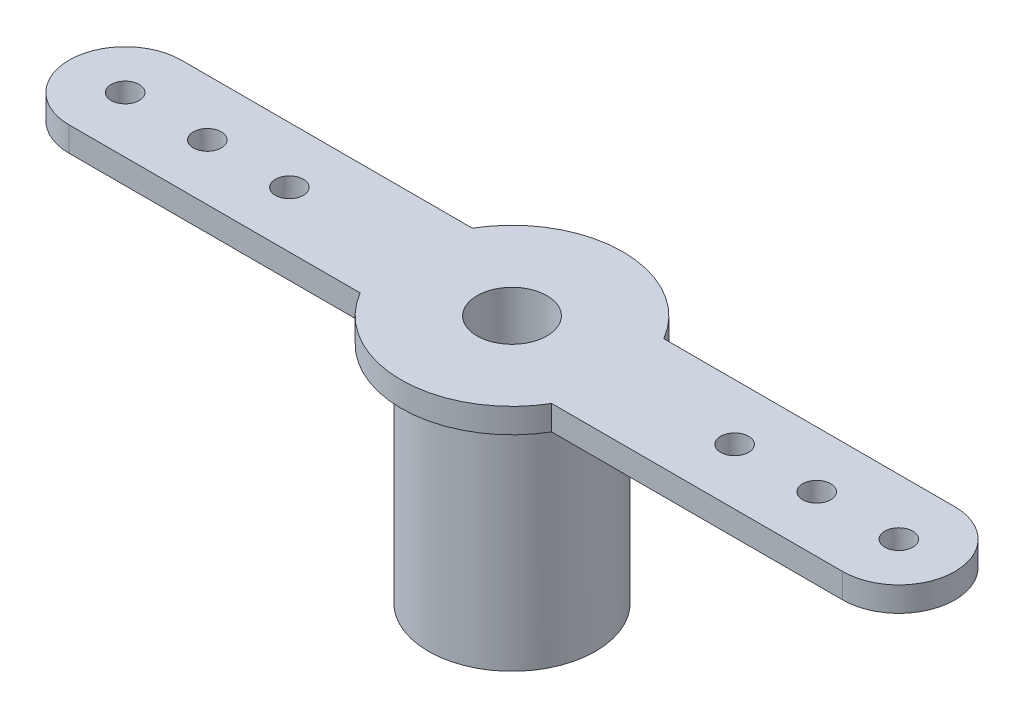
ISO-10303-21;
HEADER;
FILE_DESCRIPTION(('STEP AP214'),'2;1');
FILE_NAME('part.step','',(''),(''),'','','');
FILE_SCHEMA(('AUTOMOTIVE_DESIGN { 1 0 10303 214 1 1 1 1 }'));
ENDSEC;
DATA;
#1=APPLICATION_CONTEXT('core data for automotive mechanical design processes');
#2=APPLICATION_PROTOCOL_DEFINITION('international standard','automotive_design',2000,#1);
#3=PRODUCT_CONTEXT('',#1,'mechanical');
#4=PRODUCT('Part','Part','',(#3));
#5=PRODUCT_RELATED_PRODUCT_CATEGORY('part','',(#4));
#6=PRODUCT_DEFINITION_FORMATION('','',#4);
#7=PRODUCT_DEFINITION_CONTEXT('part definition',#1,'design');
#8=PRODUCT_DEFINITION('design','',#6,#7);
#9=PRODUCT_DEFINITION_SHAPE('','',#8);
#10=(LENGTH_UNIT() NAMED_UNIT(*) SI_UNIT(.MILLI.,.METRE.));
#11=(NAMED_UNIT(*) PLANE_ANGLE_UNIT() SI_UNIT($,.RADIAN.));
#12=(NAMED_UNIT(*) SI_UNIT($,.STERADIAN.) SOLID_ANGLE_UNIT());
#13=UNCERTAINTY_MEASURE_WITH_UNIT(LENGTH_MEASURE(1.E-05),#10,'distance_accuracy_value','');
#14=(GEOMETRIC_REPRESENTATION_CONTEXT(3) GLOBAL_UNCERTAINTY_ASSIGNED_CONTEXT((#13)) GLOBAL_UNIT_ASSIGNED_CONTEXT((#10,
#11,#12)) REPRESENTATION_CONTEXT('',''));
#15=CARTESIAN_POINT('',(0.,0.,0.));
#16=DIRECTION('',(0.,0.,1.));
#17=DIRECTION('',(1.,0.,0.));
#18=AXIS2_PLACEMENT_3D('',#15,#16,#17);
#19=CARTESIAN_POINT('',(0.,0.,0.));
#20=DIRECTION('',(0.,1.,0.));
#21=DIRECTION('',(0.,0.,1.));
#22=AXIS2_PLACEMENT_3D('',#19,#20,#21);
#23=PLANE('',#22);
#24=CARTESIAN_POINT('',(17.44,0.,0.));
#25=DIRECTION('',(0.,1.,0.));
#26=DIRECTION('',(0.,0.,1.));
#27=AXIS2_PLACEMENT_3D('',#24,#25,#26);
#28=CIRCLE('',#27,0.799999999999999);
#29=CARTESIAN_POINT('',(17.44,0.,0.799999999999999));
#30=VERTEX_POINT('',#29);
#31=EDGE_CURVE('E221',#30,#30,#28,.T.);
#32=ORIENTED_EDGE('',*,*,#31,.T.);
#33=EDGE_LOOP('',(#32));
#34=FACE_BOUND('',#33,.T.);
#35=CARTESIAN_POINT('',(22.14,0.,0.));
#36=DIRECTION('',(0.,1.,0.));
#37=DIRECTION('',(0.,0.,1.));
#38=AXIS2_PLACEMENT_3D('',#35,#36,#37);
#39=CIRCLE('',#38,0.800000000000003);
#40=CARTESIAN_POINT('',(22.14,0.,0.800000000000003));
#41=VERTEX_POINT('',#40);
#42=EDGE_CURVE('E209',#41,#41,#39,.T.);
#43=ORIENTED_EDGE('',*,*,#42,.T.);
#44=EDGE_LOOP('',(#43));
#45=FACE_BOUND('',#44,.T.);
#46=CARTESIAN_POINT('',(-12.74,0.,0.));
#47=DIRECTION('',(0.,1.,0.));
#48=DIRECTION('',(0.,0.,1.));
#49=AXIS2_PLACEMENT_3D('',#46,#47,#48);
#50=CIRCLE('',#49,0.800000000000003);
#51=CARTESIAN_POINT('',(-12.74,0.,0.800000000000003));
#52=VERTEX_POINT('',#51);
#53=EDGE_CURVE('E197',#52,#52,#50,.T.);
#54=ORIENTED_EDGE('',*,*,#53,.T.);
#55=EDGE_LOOP('',(#54));
#56=FACE_BOUND('',#55,.T.);
#57=CARTESIAN_POINT('',(0.,0.,0.));
#58=DIRECTION('',(0.,1.,0.));
#59=DIRECTION('',(0.,0.,1.));
#60=AXIS2_PLACEMENT_3D('',#57,#58,#59);
#61=CIRCLE('',#60,6.35);
#62=CARTESIAN_POINT('',(5.47890500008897,0.,-3.21000000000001));
#63=VERTEX_POINT('',#62);
#64=CARTESIAN_POINT('',(-5.47890500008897,0.,-3.21000000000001));
#65=VERTEX_POINT('',#64);
#66=EDGE_CURVE('E138',#63,#65,#61,.T.);
#67=ORIENTED_EDGE('',*,*,#66,.F.);
#68=DIRECTION('',(-1.,0.,0.));
#69=VECTOR('',#68,1.);
#70=CARTESIAN_POINT('',(5.47890500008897,0.,-3.21000000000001));
#71=LINE('',#70,#69);
#72=CARTESIAN_POINT('',(22.14,0.,-3.21));
#73=VERTEX_POINT('',#72);
#74=EDGE_CURVE('E91',#73,#63,#71,.T.);
#75=ORIENTED_EDGE('',*,*,#74,.F.);
#76=CARTESIAN_POINT('',(22.14,0.,0.));
#77=DIRECTION('',(0.,1.,0.));
#78=DIRECTION('',(0.,0.,1.));
#79=AXIS2_PLACEMENT_3D('',#76,#77,#78);
#80=CIRCLE('',#79,3.21);
#81=CARTESIAN_POINT('',(22.14,0.,3.21));
#82=VERTEX_POINT('',#81);
#83=EDGE_CURVE('E85',#82,#73,#80,.T.);
#84=ORIENTED_EDGE('',*,*,#83,.F.);
#85=DIRECTION('',(1.,0.,0.));
#86=VECTOR('',#85,1.);
#87=CARTESIAN_POINT('',(22.14,0.,3.21));
#88=LINE('',#87,#86);
#89=CARTESIAN_POINT('',(5.47890500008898,0.,3.21));
#90=VERTEX_POINT('',#89);
#91=EDGE_CURVE('E128',#90,#82,#88,.T.);
#92=ORIENTED_EDGE('',*,*,#91,.F.);
#93=CARTESIAN_POINT('',(0.,0.,0.));
#94=DIRECTION('',(0.,1.,0.));
#95=DIRECTION('',(0.,0.,1.));
#96=AXIS2_PLACEMENT_3D('',#93,#94,#95);
#97=CIRCLE('',#96,6.35);
#98=CARTESIAN_POINT('',(-5.47890500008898,0.,3.21));
#99=VERTEX_POINT('',#98);
#100=EDGE_CURVE('E148',#99,#90,#97,.T.);
#101=ORIENTED_EDGE('',*,*,#100,.F.);
#102=DIRECTION('',(1.,0.,0.));
#103=VECTOR('',#102,1.);
#104=CARTESIAN_POINT('',(-5.47890500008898,0.,3.21));
#105=LINE('',#104,#103);
#106=CARTESIAN_POINT('',(-22.14,0.,3.21));
#107=VERTEX_POINT('',#106);
#108=EDGE_CURVE('E146',#107,#99,#105,.T.);
#109=ORIENTED_EDGE('',*,*,#108,.F.);
#110=CARTESIAN_POINT('',(-22.14,0.,0.));
#111=DIRECTION('',(0.,1.,0.));
#112=DIRECTION('',(0.,0.,1.));
#113=AXIS2_PLACEMENT_3D('',#110,#111,#112);
#114=CIRCLE('',#113,3.21);
#115=CARTESIAN_POINT('',(-22.14,0.,-3.21));
#116=VERTEX_POINT('',#115);
#117=EDGE_CURVE('E144',#116,#107,#114,.T.);
#118=ORIENTED_EDGE('',*,*,#117,.F.);
#119=DIRECTION('',(-1.,0.,0.));
#120=VECTOR('',#119,1.);
#121=CARTESIAN_POINT('',(-22.14,0.,-3.21));
#122=LINE('',#121,#120);
#123=EDGE_CURVE('E141',#65,#116,#122,.T.);
#124=ORIENTED_EDGE('',*,*,#123,.F.);
#125=EDGE_LOOP('',(#67,#75,#84,#92,#101,#109,#118,#124));
#126=FACE_BOUND('',#125,.T.);
#127=CARTESIAN_POINT('',(-22.14,0.,0.));
#128=DIRECTION('',(0.,1.,0.));
#129=DIRECTION('',(0.,0.,1.));
#130=AXIS2_PLACEMENT_3D('',#127,#128,#129);
#131=CIRCLE('',#130,0.800000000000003);
#132=CARTESIAN_POINT('',(-22.14,0.,0.800000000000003));
#133=VERTEX_POINT('',#132);
#134=EDGE_CURVE('E191',#133,#133,#131,.T.);
#135=ORIENTED_EDGE('',*,*,#134,.T.);
#136=EDGE_LOOP('',(#135));
#137=FACE_BOUND('',#136,.T.);
#138=CARTESIAN_POINT('',(-17.44,0.,0.));
#139=DIRECTION('',(0.,1.,0.));
#140=DIRECTION('',(0.,0.,1.));
#141=AXIS2_PLACEMENT_3D('',#138,#139,#140);
#142=CIRCLE('',#141,0.800000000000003);
#143=CARTESIAN_POINT('',(-17.44,0.,0.800000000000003));
#144=VERTEX_POINT('',#143);
#145=EDGE_CURVE('E203',#144,#144,#142,.T.);
#146=ORIENTED_EDGE('',*,*,#145,.T.);
#147=EDGE_LOOP('',(#146));
#148=FACE_BOUND('',#147,.T.);
#149=CARTESIAN_POINT('',(12.74,0.,0.));
#150=DIRECTION('',(0.,1.,0.));
#151=DIRECTION('',(0.,0.,1.));
#152=AXIS2_PLACEMENT_3D('',#149,#150,#151);
#153=CIRCLE('',#152,0.800000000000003);
#154=CARTESIAN_POINT('',(12.74,0.,0.800000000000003));
#155=VERTEX_POINT('',#154);
#156=EDGE_CURVE('E215',#155,#155,#153,.T.);
#157=ORIENTED_EDGE('',*,*,#156,.T.);
#158=EDGE_LOOP('',(#157));
#159=FACE_BOUND('',#158,.T.);
#160=CARTESIAN_POINT('',(0.,0.,0.));
#161=DIRECTION('',(0.,1.,0.));
#162=DIRECTION('',(0.,0.,1.));
#163=AXIS2_PLACEMENT_3D('',#160,#161,#162);
#164=CIRCLE('',#163,4.785);
#165=CARTESIAN_POINT('',(0.,0.,4.785));
#166=VERTEX_POINT('',#165);
#167=EDGE_CURVE('E11',#166,#166,#164,.F.);
#168=ORIENTED_EDGE('',*,*,#167,.F.);
#169=EDGE_LOOP('',(#168));
#170=FACE_BOUND('',#169,.T.);
#171=ADVANCED_FACE('F34',(#34,#45,#56,#126,#137,#148,#159,#170),#23,.F.);
#172=CARTESIAN_POINT('',(0.,1.41,0.));
#173=DIRECTION('',(0.,1.,0.));
#174=DIRECTION('',(0.,0.,1.));
#175=AXIS2_PLACEMENT_3D('',#172,#173,#174);
#176=PLANE('',#175);
#177=CARTESIAN_POINT('',(0.,1.41,0.));
#178=DIRECTION('',(0.,-1.,0.));
#179=DIRECTION('',(0.,0.,-1.));
#180=AXIS2_PLACEMENT_3D('',#177,#178,#179);
#181=CIRCLE('',#180,2.);
#182=CARTESIAN_POINT('',(0.,1.41,-2.));
#183=VERTEX_POINT('',#182);
#184=EDGE_CURVE('E229',#183,#183,#181,.T.);
#185=ORIENTED_EDGE('',*,*,#184,.T.);
#186=EDGE_LOOP('',(#185));
#187=FACE_BOUND('',#186,.T.);
#188=CARTESIAN_POINT('',(12.74,1.41,0.));
#189=DIRECTION('',(0.,1.,0.));
#190=DIRECTION('',(0.,0.,1.));
#191=AXIS2_PLACEMENT_3D('',#188,#189,#190);
#192=CIRCLE('',#191,0.800000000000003);
#193=CARTESIAN_POINT('',(12.74,1.41,0.800000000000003));
#194=VERTEX_POINT('',#193);
#195=EDGE_CURVE('E212',#194,#194,#192,.T.);
#196=ORIENTED_EDGE('',*,*,#195,.F.);
#197=EDGE_LOOP('',(#196));
#198=FACE_BOUND('',#197,.T.);
#199=CARTESIAN_POINT('',(-17.44,1.41,0.));
#200=DIRECTION('',(0.,1.,0.));
#201=DIRECTION('',(0.,0.,1.));
#202=AXIS2_PLACEMENT_3D('',#199,#200,#201);
#203=CIRCLE('',#202,0.800000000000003);
#204=CARTESIAN_POINT('',(-17.44,1.41,0.800000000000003));
#205=VERTEX_POINT('',#204);
#206=EDGE_CURVE('E200',#205,#205,#203,.T.);
#207=ORIENTED_EDGE('',*,*,#206,.F.);
#208=EDGE_LOOP('',(#207));
#209=FACE_BOUND('',#208,.T.);
#210=CARTESIAN_POINT('',(-22.14,1.41,0.));
#211=DIRECTION('',(0.,1.,0.));
#212=DIRECTION('',(0.,0.,1.));
#213=AXIS2_PLACEMENT_3D('',#210,#211,#212);
#214=CIRCLE('',#213,0.800000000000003);
#215=CARTESIAN_POINT('',(-22.14,1.41,0.800000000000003));
#216=VERTEX_POINT('',#215);
#217=EDGE_CURVE('E142',#216,#216,#214,.T.);
#218=ORIENTED_EDGE('',*,*,#217,.F.);
#219=EDGE_LOOP('',(#218));
#220=FACE_BOUND('',#219,.T.);
#221=CARTESIAN_POINT('',(0.,1.41,0.));
#222=DIRECTION('',(0.,1.,0.));
#223=DIRECTION('',(0.,0.,1.));
#224=AXIS2_PLACEMENT_3D('',#221,#222,#223);
#225=CIRCLE('',#224,6.35);
#226=CARTESIAN_POINT('',(5.47890500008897,1.41,-3.21000000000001));
#227=VERTEX_POINT('',#226);
#228=CARTESIAN_POINT('',(-5.47890500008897,1.41,-3.21000000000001));
#229=VERTEX_POINT('',#228);
#230=EDGE_CURVE('E153',#227,#229,#225,.T.);
#231=ORIENTED_EDGE('',*,*,#230,.T.);
#232=DIRECTION('',(-1.,0.,0.));
#233=VECTOR('',#232,1.);
#234=CARTESIAN_POINT('',(-22.14,1.41,-3.21));
#235=LINE('',#234,#233);
#236=CARTESIAN_POINT('',(-22.14,1.41,-3.21));
#237=VERTEX_POINT('',#236);
#238=EDGE_CURVE('E100',#229,#237,#235,.T.);
#239=ORIENTED_EDGE('',*,*,#238,.T.);
#240=CARTESIAN_POINT('',(-22.14,1.41,0.));
#241=DIRECTION('',(0.,1.,0.));
#242=DIRECTION('',(0.,0.,1.));
#243=AXIS2_PLACEMENT_3D('',#240,#241,#242);
#244=CIRCLE('',#243,3.21);
#245=CARTESIAN_POINT('',(-22.14,1.41,3.21));
#246=VERTEX_POINT('',#245);
#247=EDGE_CURVE('E185',#237,#246,#244,.T.);
#248=ORIENTED_EDGE('',*,*,#247,.T.);
#249=DIRECTION('',(1.,0.,0.));
#250=VECTOR('',#249,1.);
#251=CARTESIAN_POINT('',(-5.47890500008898,1.41,3.21));
#252=LINE('',#251,#250);
#253=CARTESIAN_POINT('',(-5.47890500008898,1.41,3.21));
#254=VERTEX_POINT('',#253);
#255=EDGE_CURVE('E184',#246,#254,#252,.T.);
#256=ORIENTED_EDGE('',*,*,#255,.T.);
#257=CARTESIAN_POINT('',(0.,1.41,0.));
#258=DIRECTION('',(0.,1.,0.));
#259=DIRECTION('',(0.,0.,1.));
#260=AXIS2_PLACEMENT_3D('',#257,#258,#259);
#261=CIRCLE('',#260,6.35);
#262=CARTESIAN_POINT('',(5.47890500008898,1.41,3.21));
#263=VERTEX_POINT('',#262);
#264=EDGE_CURVE('E120',#254,#263,#261,.T.);
#265=ORIENTED_EDGE('',*,*,#264,.T.);
#266=DIRECTION('',(1.,0.,0.));
#267=VECTOR('',#266,1.);
#268=CARTESIAN_POINT('',(22.14,1.41,3.21));
#269=LINE('',#268,#267);
#270=CARTESIAN_POINT('',(22.14,1.41,3.21));
#271=VERTEX_POINT('',#270);
#272=EDGE_CURVE('E113',#263,#271,#269,.T.);
#273=ORIENTED_EDGE('',*,*,#272,.T.);
#274=CARTESIAN_POINT('',(22.14,1.41,0.));
#275=DIRECTION('',(0.,1.,0.));
#276=DIRECTION('',(0.,0.,1.));
#277=AXIS2_PLACEMENT_3D('',#274,#275,#276);
#278=CIRCLE('',#277,3.21);
#279=CARTESIAN_POINT('',(22.14,1.41,-3.21));
#280=VERTEX_POINT('',#279);
#281=EDGE_CURVE('E118',#271,#280,#278,.T.);
#282=ORIENTED_EDGE('',*,*,#281,.T.);
#283=DIRECTION('',(-1.,0.,0.));
#284=VECTOR('',#283,1.);
#285=CARTESIAN_POINT('',(5.47890500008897,1.41,-3.21000000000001));
#286=LINE('',#285,#284);
#287=EDGE_CURVE('E56',#280,#227,#286,.T.);
#288=ORIENTED_EDGE('',*,*,#287,.T.);
#289=EDGE_LOOP('',(#231,#239,#248,#256,#265,#273,#282,#288));
#290=FACE_BOUND('',#289,.T.);
#291=CARTESIAN_POINT('',(-12.74,1.41,0.));
#292=DIRECTION('',(0.,1.,0.));
#293=DIRECTION('',(0.,0.,1.));
#294=AXIS2_PLACEMENT_3D('',#291,#292,#293);
#295=CIRCLE('',#294,0.800000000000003);
#296=CARTESIAN_POINT('',(-12.74,1.41,0.800000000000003));
#297=VERTEX_POINT('',#296);
#298=EDGE_CURVE('E194',#297,#297,#295,.T.);
#299=ORIENTED_EDGE('',*,*,#298,.F.);
#300=EDGE_LOOP('',(#299));
#301=FACE_BOUND('',#300,.T.);
#302=CARTESIAN_POINT('',(22.14,1.41,0.));
#303=DIRECTION('',(0.,1.,0.));
#304=DIRECTION('',(0.,0.,1.));
#305=AXIS2_PLACEMENT_3D('',#302,#303,#304);
#306=CIRCLE('',#305,0.800000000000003);
#307=CARTESIAN_POINT('',(22.14,1.41,0.800000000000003));
#308=VERTEX_POINT('',#307);
#309=EDGE_CURVE('E206',#308,#308,#306,.T.);
#310=ORIENTED_EDGE('',*,*,#309,.F.);
#311=EDGE_LOOP('',(#310));
#312=FACE_BOUND('',#311,.T.);
#313=CARTESIAN_POINT('',(17.44,1.41,0.));
#314=DIRECTION('',(0.,1.,0.));
#315=DIRECTION('',(0.,0.,1.));
#316=AXIS2_PLACEMENT_3D('',#313,#314,#315);
#317=CIRCLE('',#316,0.799999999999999);
#318=CARTESIAN_POINT('',(17.44,1.41,0.799999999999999));
#319=VERTEX_POINT('',#318);
#320=EDGE_CURVE('E218',#319,#319,#317,.T.);
#321=ORIENTED_EDGE('',*,*,#320,.F.);
#322=EDGE_LOOP('',(#321));
#323=FACE_BOUND('',#322,.T.);
#324=ADVANCED_FACE('F115',(#187,#198,#209,#220,#290,#301,#312,#323),#176,.T.);
#325=CARTESIAN_POINT('',(0.,1.41,0.));
#326=DIRECTION('',(0.,-1.,0.));
#327=DIRECTION('',(0.,0.,-1.));
#328=AXIS2_PLACEMENT_3D('',#325,#326,#327);
#329=CYLINDRICAL_SURFACE('',#328,6.35);
#330=ORIENTED_EDGE('',*,*,#66,.T.);
#331=DIRECTION('',(0.,-1.,0.));
#332=VECTOR('',#331,1.);
#333=CARTESIAN_POINT('',(-5.47890500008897,1.41,-3.21000000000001));
#334=LINE('',#333,#332);
#335=EDGE_CURVE('E48',#229,#65,#334,.T.);
#336=ORIENTED_EDGE('',*,*,#335,.F.);
#337=ORIENTED_EDGE('',*,*,#230,.F.);
#338=DIRECTION('',(0.,-1.,0.));
#339=VECTOR('',#338,1.);
#340=CARTESIAN_POINT('',(5.47890500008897,1.41,-3.21000000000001));
#341=LINE('',#340,#339);
#342=EDGE_CURVE('E134',#227,#63,#341,.T.);
#343=ORIENTED_EDGE('',*,*,#342,.T.);
#344=EDGE_LOOP('',(#330,#336,#337,#343));
#345=FACE_BOUND('',#344,.T.);
#346=ADVANCED_FACE('F36',(#345),#329,.T.);
#347=CARTESIAN_POINT('',(-22.14,1.41,-3.21));
#348=DIRECTION('',(0.,0.,1.));
#349=DIRECTION('',(1.,0.,0.));
#350=AXIS2_PLACEMENT_3D('',#347,#348,#349);
#351=PLANE('',#350);
#352=ORIENTED_EDGE('',*,*,#123,.T.);
#353=DIRECTION('',(0.,-1.,0.));
#354=VECTOR('',#353,1.);
#355=CARTESIAN_POINT('',(-22.14,1.41,-3.21));
#356=LINE('',#355,#354);
#357=EDGE_CURVE('E163',#237,#116,#356,.T.);
#358=ORIENTED_EDGE('',*,*,#357,.F.);
#359=ORIENTED_EDGE('',*,*,#238,.F.);
#360=ORIENTED_EDGE('',*,*,#335,.T.);
#361=EDGE_LOOP('',(#352,#358,#359,#360));
#362=FACE_BOUND('',#361,.T.);
#363=ADVANCED_FACE('F167',(#362),#351,.F.);
#364=CARTESIAN_POINT('',(-22.14,1.41,0.));
#365=DIRECTION('',(0.,-1.,0.));
#366=DIRECTION('',(0.,0.,-1.));
#367=AXIS2_PLACEMENT_3D('',#364,#365,#366);
#368=CYLINDRICAL_SURFACE('',#367,3.21);
#369=ORIENTED_EDGE('',*,*,#117,.T.);
#370=DIRECTION('',(0.,-1.,0.));
#371=VECTOR('',#370,1.);
#372=CARTESIAN_POINT('',(-22.14,1.41,3.21));
#373=LINE('',#372,#371);
#374=EDGE_CURVE('E160',#246,#107,#373,.T.);
#375=ORIENTED_EDGE('',*,*,#374,.F.);
#376=ORIENTED_EDGE('',*,*,#247,.F.);
#377=ORIENTED_EDGE('',*,*,#357,.T.);
#378=EDGE_LOOP('',(#369,#375,#376,#377));
#379=FACE_BOUND('',#378,.T.);
#380=ADVANCED_FACE('F178',(#379),#368,.T.);
#381=CARTESIAN_POINT('',(-5.47890500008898,1.41,3.21));
#382=DIRECTION('',(0.,0.,-1.));
#383=DIRECTION('',(-1.,0.,0.));
#384=AXIS2_PLACEMENT_3D('',#381,#382,#383);
#385=PLANE('',#384);
#386=ORIENTED_EDGE('',*,*,#108,.T.);
#387=DIRECTION('',(0.,-1.,0.));
#388=VECTOR('',#387,1.);
#389=CARTESIAN_POINT('',(-5.47890500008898,1.41,3.21));
#390=LINE('',#389,#388);
#391=EDGE_CURVE('E157',#254,#99,#390,.T.);
#392=ORIENTED_EDGE('',*,*,#391,.F.);
#393=ORIENTED_EDGE('',*,*,#255,.F.);
#394=ORIENTED_EDGE('',*,*,#374,.T.);
#395=EDGE_LOOP('',(#386,#392,#393,#394));
#396=FACE_BOUND('',#395,.T.);
#397=ADVANCED_FACE('F182',(#396),#385,.F.);
#398=CARTESIAN_POINT('',(0.,1.41,0.));
#399=DIRECTION('',(0.,-1.,0.));
#400=DIRECTION('',(0.,0.,-1.));
#401=AXIS2_PLACEMENT_3D('',#398,#399,#400);
#402=CYLINDRICAL_SURFACE('',#401,6.35);
#403=ORIENTED_EDGE('',*,*,#100,.T.);
#404=DIRECTION('',(0.,-1.,0.));
#405=VECTOR('',#404,1.);
#406=CARTESIAN_POINT('',(5.47890500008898,1.41,3.21));
#407=LINE('',#406,#405);
#408=EDGE_CURVE('E129',#263,#90,#407,.T.);
#409=ORIENTED_EDGE('',*,*,#408,.F.);
#410=ORIENTED_EDGE('',*,*,#264,.F.);
#411=ORIENTED_EDGE('',*,*,#391,.T.);
#412=EDGE_LOOP('',(#403,#409,#410,#411));
#413=FACE_BOUND('',#412,.T.);
#414=ADVANCED_FACE('F282',(#413),#402,.T.);
#415=CARTESIAN_POINT('',(22.14,1.41,3.21));
#416=DIRECTION('',(0.,0.,-1.));
#417=DIRECTION('',(-1.,0.,0.));
#418=AXIS2_PLACEMENT_3D('',#415,#416,#417);
#419=PLANE('',#418);
#420=ORIENTED_EDGE('',*,*,#91,.T.);
#421=DIRECTION('',(0.,-1.,0.));
#422=VECTOR('',#421,1.);
#423=CARTESIAN_POINT('',(22.14,1.41,3.21));
#424=LINE('',#423,#422);
#425=EDGE_CURVE('E125',#271,#82,#424,.T.);
#426=ORIENTED_EDGE('',*,*,#425,.F.);
#427=ORIENTED_EDGE('',*,*,#272,.F.);
#428=ORIENTED_EDGE('',*,*,#408,.T.);
#429=EDGE_LOOP('',(#420,#426,#427,#428));
#430=FACE_BOUND('',#429,.T.);
#431=ADVANCED_FACE('F126',(#430),#419,.F.);
#432=CARTESIAN_POINT('',(22.14,1.41,0.));
#433=DIRECTION('',(0.,-1.,0.));
#434=DIRECTION('',(0.,0.,-1.));
#435=AXIS2_PLACEMENT_3D('',#432,#433,#434);
#436=CYLINDRICAL_SURFACE('',#435,3.21);
#437=ORIENTED_EDGE('',*,*,#83,.T.);
#438=DIRECTION('',(0.,-1.,0.));
#439=VECTOR('',#438,1.);
#440=CARTESIAN_POINT('',(22.14,1.41,-3.21));
#441=LINE('',#440,#439);
#442=EDGE_CURVE('E130',#280,#73,#441,.T.);
#443=ORIENTED_EDGE('',*,*,#442,.F.);
#444=ORIENTED_EDGE('',*,*,#281,.F.);
#445=ORIENTED_EDGE('',*,*,#425,.T.);
#446=EDGE_LOOP('',(#437,#443,#444,#445));
#447=FACE_BOUND('',#446,.T.);
#448=ADVANCED_FACE('F132',(#447),#436,.T.);
#449=CARTESIAN_POINT('',(5.47890500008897,1.41,-3.21000000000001));
#450=DIRECTION('',(0.,0.,1.));
#451=DIRECTION('',(1.,0.,0.));
#452=AXIS2_PLACEMENT_3D('',#449,#450,#451);
#453=PLANE('',#452);
#454=ORIENTED_EDGE('',*,*,#74,.T.);
#455=ORIENTED_EDGE('',*,*,#342,.F.);
#456=ORIENTED_EDGE('',*,*,#287,.F.);
#457=ORIENTED_EDGE('',*,*,#442,.T.);
#458=EDGE_LOOP('',(#454,#455,#456,#457));
#459=FACE_BOUND('',#458,.T.);
#460=ADVANCED_FACE('F274',(#459),#453,.F.);
#461=CARTESIAN_POINT('',(-22.14,1.41,0.));
#462=DIRECTION('',(0.,-1.,0.));
#463=DIRECTION('',(0.,0.,-1.));
#464=AXIS2_PLACEMENT_3D('',#461,#462,#463);
#465=CYLINDRICAL_SURFACE('',#464,0.800000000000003);
#466=ORIENTED_EDGE('',*,*,#217,.T.);
#467=EDGE_LOOP('',(#466));
#468=FACE_BOUND('',#467,.T.);
#469=ORIENTED_EDGE('',*,*,#134,.F.);
#470=EDGE_LOOP('',(#469));
#471=FACE_BOUND('',#470,.T.);
#472=ADVANCED_FACE('F277',(#468,#471),#465,.F.);
#473=CARTESIAN_POINT('',(-12.74,1.41,0.));
#474=DIRECTION('',(0.,-1.,0.));
#475=DIRECTION('',(0.,0.,-1.));
#476=AXIS2_PLACEMENT_3D('',#473,#474,#475);
#477=CYLINDRICAL_SURFACE('',#476,0.800000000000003);
#478=ORIENTED_EDGE('',*,*,#298,.T.);
#479=EDGE_LOOP('',(#478));
#480=FACE_BOUND('',#479,.T.);
#481=ORIENTED_EDGE('',*,*,#53,.F.);
#482=EDGE_LOOP('',(#481));
#483=FACE_BOUND('',#482,.T.);
#484=ADVANCED_FACE('F354',(#480,#483),#477,.F.);
#485=CARTESIAN_POINT('',(-17.44,1.41,0.));
#486=DIRECTION('',(0.,-1.,0.));
#487=DIRECTION('',(0.,0.,-1.));
#488=AXIS2_PLACEMENT_3D('',#485,#486,#487);
#489=CYLINDRICAL_SURFACE('',#488,0.800000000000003);
#490=ORIENTED_EDGE('',*,*,#206,.T.);
#491=EDGE_LOOP('',(#490));
#492=FACE_BOUND('',#491,.T.);
#493=ORIENTED_EDGE('',*,*,#145,.F.);
#494=EDGE_LOOP('',(#493));
#495=FACE_BOUND('',#494,.T.);
#496=ADVANCED_FACE('F346',(#492,#495),#489,.F.);
#497=CARTESIAN_POINT('',(22.14,1.41,0.));
#498=DIRECTION('',(0.,-1.,0.));
#499=DIRECTION('',(0.,0.,-1.));
#500=AXIS2_PLACEMENT_3D('',#497,#498,#499);
#501=CYLINDRICAL_SURFACE('',#500,0.800000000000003);
#502=ORIENTED_EDGE('',*,*,#309,.T.);
#503=EDGE_LOOP('',(#502));
#504=FACE_BOUND('',#503,.T.);
#505=ORIENTED_EDGE('',*,*,#42,.F.);
#506=EDGE_LOOP('',(#505));
#507=FACE_BOUND('',#506,.T.);
#508=ADVANCED_FACE('F338',(#504,#507),#501,.F.);
#509=CARTESIAN_POINT('',(12.74,1.41,0.));
#510=DIRECTION('',(0.,-1.,0.));
#511=DIRECTION('',(0.,0.,-1.));
#512=AXIS2_PLACEMENT_3D('',#509,#510,#511);
#513=CYLINDRICAL_SURFACE('',#512,0.800000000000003);
#514=ORIENTED_EDGE('',*,*,#195,.T.);
#515=EDGE_LOOP('',(#514));
#516=FACE_BOUND('',#515,.T.);
#517=ORIENTED_EDGE('',*,*,#156,.F.);
#518=EDGE_LOOP('',(#517));
#519=FACE_BOUND('',#518,.T.);
#520=ADVANCED_FACE('F331',(#516,#519),#513,.F.);
#521=CARTESIAN_POINT('',(17.44,1.41,0.));
#522=DIRECTION('',(0.,-1.,0.));
#523=DIRECTION('',(0.,0.,-1.));
#524=AXIS2_PLACEMENT_3D('',#521,#522,#523);
#525=CYLINDRICAL_SURFACE('',#524,0.799999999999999);
#526=ORIENTED_EDGE('',*,*,#320,.T.);
#527=EDGE_LOOP('',(#526));
#528=FACE_BOUND('',#527,.T.);
#529=ORIENTED_EDGE('',*,*,#31,.F.);
#530=EDGE_LOOP('',(#529));
#531=FACE_BOUND('',#530,.T.);
#532=ADVANCED_FACE('F259',(#528,#531),#525,.F.);
#533=CARTESIAN_POINT('',(0.,-12.83,0.));
#534=DIRECTION('',(0.,1.,0.));
#535=DIRECTION('',(0.,0.,1.));
#536=AXIS2_PLACEMENT_3D('',#533,#534,#535);
#537=CYLINDRICAL_SURFACE('',#536,4.785);
#538=CARTESIAN_POINT('',(1.72,-6.01,-4.46517916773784));
#539=CARTESIAN_POINT('',(1.72000219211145,-5.9168021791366,-4.46517722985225));
#540=CARTESIAN_POINT('',(1.71239976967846,-5.82361944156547,-4.46812880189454));
#541=CARTESIAN_POINT('',(1.68231532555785,-5.64004484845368,-4.47954181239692));
#542=CARTESIAN_POINT('',(1.65983272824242,-5.54965310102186,-4.4880034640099));
#543=CARTESIAN_POINT('',(1.60090422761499,-5.37435669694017,-4.50935695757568));
#544=CARTESIAN_POINT('',(1.5644893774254,-5.2894403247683,-4.52223894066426));
#545=CARTESIAN_POINT('',(1.47883870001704,-5.12689068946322,-4.55096634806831));
#546=CARTESIAN_POINT('',(1.42959938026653,-5.04925941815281,-4.56681257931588));
#547=CARTESIAN_POINT('',(1.31729266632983,-4.89994401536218,-4.6004928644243));
#548=CARTESIAN_POINT('',(1.25373681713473,-4.82863961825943,-4.61838207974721));
#549=CARTESIAN_POINT('',(1.1156398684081,-4.69743694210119,-4.65367023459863));
#550=CARTESIAN_POINT('',(1.04109666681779,-4.63754085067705,-4.6710690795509));
#551=CARTESIAN_POINT('',(0.88029941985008,-4.52906722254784,-4.70406519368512));
#552=CARTESIAN_POINT('',(0.793754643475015,-4.48089670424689,-4.71959016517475));
#553=CARTESIAN_POINT('',(0.613134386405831,-4.39995320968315,-4.74643134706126));
#554=CARTESIAN_POINT('',(0.519061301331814,-4.36717535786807,-4.75774888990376));
#555=CARTESIAN_POINT('',(0.330043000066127,-4.3192623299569,-4.77450881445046));
#556=CARTESIAN_POINT('',(0.235282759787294,-4.30347465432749,-4.78016784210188));
#557=CARTESIAN_POINT('',(0.0443002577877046,-4.28790560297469,-4.78574734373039));
#558=CARTESIAN_POINT('',(-0.0519215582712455,-4.28811944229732,-4.78566953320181));
#559=CARTESIAN_POINT('',(-0.238441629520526,-4.30415424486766,-4.77992542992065));
#560=CARTESIAN_POINT('',(-0.328810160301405,-4.31926440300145,-4.77451365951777));
#561=CARTESIAN_POINT('',(-0.505631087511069,-4.36347507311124,-4.75903802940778));
#562=CARTESIAN_POINT('',(-0.592083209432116,-4.39257656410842,-4.74897384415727));
#563=CARTESIAN_POINT('',(-0.760058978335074,-4.46430579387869,-4.72502283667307));
#564=CARTESIAN_POINT('',(-0.841495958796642,-4.50711844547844,-4.71108412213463));
#565=CARTESIAN_POINT('',(-0.99622507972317,-4.6048957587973,-4.68081032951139));
#566=CARTESIAN_POINT('',(-1.06951470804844,-4.65986415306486,-4.66447451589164));
#567=CARTESIAN_POINT('',(-1.21007431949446,-4.783879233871,-4.63006091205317));
#568=CARTESIAN_POINT('',(-1.27680323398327,-4.85352719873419,-4.61193669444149));
#569=CARTESIAN_POINT('',(-1.39782701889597,-5.00315289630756,-4.57671135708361));
#570=CARTESIAN_POINT('',(-1.45211926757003,-5.08313280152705,-4.55961045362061));
#571=CARTESIAN_POINT('',(-1.54764864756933,-5.25312267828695,-4.52808967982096));
#572=CARTESIAN_POINT('',(-1.58861909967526,-5.34329390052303,-4.51372670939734));
#573=CARTESIAN_POINT('',(-1.65459691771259,-5.52990625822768,-4.48996419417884));
#574=CARTESIAN_POINT('',(-1.67961230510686,-5.62634421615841,-4.48056215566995));
#575=CARTESIAN_POINT('',(-1.71178932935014,-5.81744317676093,-4.46836490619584));
#576=CARTESIAN_POINT('',(-1.71980289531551,-5.91194055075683,-4.46525482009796));
#577=CARTESIAN_POINT('',(-1.72018978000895,-6.10096045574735,-4.46510633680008));
#578=CARTESIAN_POINT('',(-1.71256656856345,-6.19548297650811,-4.46806659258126));
#579=CARTESIAN_POINT('',(-1.68266633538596,-6.37769760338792,-4.47940763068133));
#580=CARTESIAN_POINT('',(-1.6610213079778,-6.46550962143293,-4.48755438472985));
#581=CARTESIAN_POINT('',(-1.60447269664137,-6.63622459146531,-4.5080806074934));
#582=CARTESIAN_POINT('',(-1.56956653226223,-6.71912658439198,-4.52046089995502));
#583=CARTESIAN_POINT('',(-1.48609020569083,-6.88092785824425,-4.54859989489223));
#584=CARTESIAN_POINT('',(-1.43708002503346,-6.95958150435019,-4.56446269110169));
#585=CARTESIAN_POINT('',(-1.3272664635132,-7.10785310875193,-4.5975943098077));
#586=CARTESIAN_POINT('',(-1.26645907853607,-7.17746798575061,-4.61486360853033));
#587=CARTESIAN_POINT('',(-1.13064280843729,-7.30982407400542,-4.65006039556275));
#588=CARTESIAN_POINT('',(-1.05501924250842,-7.37194165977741,-4.66796879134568));
#589=CARTESIAN_POINT('',(-0.893979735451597,-7.48266642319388,-4.70146571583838));
#590=CARTESIAN_POINT('',(-0.808563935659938,-7.53127379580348,-4.71705427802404));
#591=CARTESIAN_POINT('',(-0.63058589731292,-7.61321784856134,-4.74411626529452));
#592=CARTESIAN_POINT('',(-0.53806104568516,-7.64662877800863,-4.75560963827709));
#593=CARTESIAN_POINT('',(-0.34820214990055,-7.69724509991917,-4.77326424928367));
#594=CARTESIAN_POINT('',(-0.250870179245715,-7.71445741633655,-4.77942776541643));
#595=CARTESIAN_POINT('',(-0.0598211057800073,-7.73148753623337,-4.78552901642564));
#596=CARTESIAN_POINT('',(0.033807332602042,-7.73219455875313,-4.78578500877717));
#597=CARTESIAN_POINT('',(0.219788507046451,-7.71844519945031,-4.78085437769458));
#598=CARTESIAN_POINT('',(0.312141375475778,-7.70399040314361,-4.77566832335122));
#599=CARTESIAN_POINT('',(0.490999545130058,-7.66094132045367,-4.76057138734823));
#600=CARTESIAN_POINT('',(0.57758678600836,-7.63264935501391,-4.75076168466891));
#601=CARTESIAN_POINT('',(0.74480367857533,-7.56302119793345,-4.72743347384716));
#602=CARTESIAN_POINT('',(0.825432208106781,-7.52168255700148,-4.71391426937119));
#603=CARTESIAN_POINT('',(0.981997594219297,-7.42522891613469,-4.68385715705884));
#604=CARTESIAN_POINT('',(1.05761416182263,-7.36962561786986,-4.66721950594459));
#605=CARTESIAN_POINT('',(1.19872486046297,-7.24701340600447,-4.63298663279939));
#606=CARTESIAN_POINT('',(1.26421549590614,-7.18000057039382,-4.61539108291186));
#607=CARTESIAN_POINT('',(1.38640053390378,-7.03268134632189,-4.58021351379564));
#608=CARTESIAN_POINT('',(1.44252988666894,-6.95189495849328,-4.56267177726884));
#609=CARTESIAN_POINT('',(1.54041245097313,-6.78148036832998,-4.53056499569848));
#610=CARTESIAN_POINT('',(1.58216633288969,-6.69185257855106,-4.51599981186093));
#611=CARTESIAN_POINT('',(1.65015726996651,-6.50529856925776,-4.49160722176));
#612=CARTESIAN_POINT('',(1.67624889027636,-6.40831308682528,-4.48182437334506));
#613=CARTESIAN_POINT('',(1.71116458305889,-6.21087801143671,-4.46861304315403));
#614=CARTESIAN_POINT('',(1.7199976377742,-6.11043024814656,-4.4651812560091));
#615=CARTESIAN_POINT('',(1.72,-6.01,-4.46517916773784));
#616=B_SPLINE_CURVE_WITH_KNOTS('',3,(#538,#539,#540,#541,#542,#543,#544,#545,#546,#547,#548,
#549,#550,#551,#552,#553,#554,#555,#556,#557,#558,#559,#560,#561,#562,#563,#564,#565,#566,#567,
#568,#569,#570,#571,#572,#573,#574,#575,#576,#577,#578,#579,#580,#581,#582,#583,#584,#585,#586,
#587,#588,#589,#590,#591,#592,#593,#594,#595,#596,#597,#598,#599,#600,#601,#602,#603,#604,#605,
#606,#607,#608,#609,#610,#611,#612,#613,#614,#615),.UNSPECIFIED.,.T.,.F.,(4,2,2,2,2,2,2,2,2,2,2,
2,2,2,2,2,2,2,2,2,2,2,2,2,2,2,2,2,2,2,2,2,2,2,2,2,2,2,4),(0.,0.279220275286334,
0.558451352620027,0.837063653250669,1.1157519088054,1.40598834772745,1.6962803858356,
1.99554410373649,2.29471296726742,2.58193027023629,2.86906168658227,3.14312424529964,
3.41720598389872,3.69515180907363,3.97318309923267,4.26627383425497,4.55942629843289,
4.85812989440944,5.15668319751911,5.43988429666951,5.72302255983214,5.99421187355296,
6.26545398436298,6.54629942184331,6.82724034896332,7.12430185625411,7.42135907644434,
7.71694886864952,8.01241225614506,8.29191859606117,8.57139571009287,8.84502243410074,
9.1187005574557,9.4034144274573,9.68822636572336,9.98655673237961,10.2848731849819,
10.5859185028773,10.8868070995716),.UNSPECIFIED.);
#617=CARTESIAN_POINT('',(1.72,-6.01,-4.46517916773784));
#618=VERTEX_POINT('',#617);
#619=EDGE_CURVE('E233',#618,#618,#616,.T.);
#620=ORIENTED_EDGE('',*,*,#619,.T.);
#621=EDGE_LOOP('',(#620));
#622=FACE_BOUND('',#621,.T.);
#623=CARTESIAN_POINT('',(0.,-12.83,0.));
#624=DIRECTION('',(0.,-1.,0.));
#625=DIRECTION('',(0.,0.,-1.));
#626=AXIS2_PLACEMENT_3D('',#623,#624,#625);
#627=CIRCLE('',#626,4.785);
#628=CARTESIAN_POINT('',(0.,-12.83,-4.785));
#629=VERTEX_POINT('',#628);
#630=EDGE_CURVE('E224',#629,#629,#627,.T.);
#631=ORIENTED_EDGE('',*,*,#630,.F.);
#632=EDGE_LOOP('',(#631));
#633=FACE_BOUND('',#632,.T.);
#634=ORIENTED_EDGE('',*,*,#167,.T.);
#635=EDGE_LOOP('',(#634));
#636=FACE_BOUND('',#635,.T.);
#637=ADVANCED_FACE('F240',(#622,#633,#636),#537,.T.);
#638=CARTESIAN_POINT('',(0.,-12.83,0.));
#639=DIRECTION('',(0.,-1.,0.));
#640=DIRECTION('',(0.,0.,-1.));
#641=AXIS2_PLACEMENT_3D('',#638,#639,#640);
#642=PLANE('',#641);
#643=CARTESIAN_POINT('',(0.,-12.83,0.));
#644=DIRECTION('',(0.,-1.,0.));
#645=DIRECTION('',(0.,0.,-1.));
#646=AXIS2_PLACEMENT_3D('',#643,#644,#645);
#647=CIRCLE('',#646,2.);
#648=CARTESIAN_POINT('',(0.,-12.83,-2.));
#649=VERTEX_POINT('',#648);
#650=EDGE_CURVE('E230',#649,#649,#647,.T.);
#651=ORIENTED_EDGE('',*,*,#650,.F.);
#652=EDGE_LOOP('',(#651));
#653=FACE_BOUND('',#652,.T.);
#654=ORIENTED_EDGE('',*,*,#630,.T.);
#655=EDGE_LOOP('',(#654));
#656=FACE_BOUND('',#655,.T.);
#657=ADVANCED_FACE('F252',(#653,#656),#642,.T.);
#658=CARTESIAN_POINT('',(0.,1.41,0.));
#659=DIRECTION('',(0.,-1.,0.));
#660=DIRECTION('',(0.,0.,-1.));
#661=AXIS2_PLACEMENT_3D('',#658,#659,#660);
#662=CYLINDRICAL_SURFACE('',#661,2.);
#663=CARTESIAN_POINT('',(0.,-4.29,-2.));
#664=CARTESIAN_POINT('',(0.080885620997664,-4.29000607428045,-1.99999403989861));
#665=CARTESIAN_POINT('',(0.161827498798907,-4.29575082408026,-1.99504766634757));
#666=CARTESIAN_POINT('',(0.321018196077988,-4.31830436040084,-1.97570290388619));
#667=CARTESIAN_POINT('',(0.399263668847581,-4.33512640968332,-1.96129318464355));
#668=CARTESIAN_POINT('',(0.550354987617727,-4.37854260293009,-1.92435021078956));
#669=CARTESIAN_POINT('',(0.623231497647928,-4.40507507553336,-1.90186824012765));
#670=CARTESIAN_POINT('',(0.762797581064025,-4.46650891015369,-1.8503209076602));
#671=CARTESIAN_POINT('',(0.829485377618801,-4.5014126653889,-1.82125366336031));
#672=CARTESIAN_POINT('',(0.980165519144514,-4.59291486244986,-1.74608184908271));
#673=CARTESIAN_POINT('',(1.06108083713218,-4.65271383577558,-1.69770390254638));
#674=CARTESIAN_POINT('',(1.20961382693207,-4.78319135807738,-1.59531081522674));
#675=CARTESIAN_POINT('',(1.27719490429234,-4.85389892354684,-1.54128076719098));
#676=CARTESIAN_POINT('',(1.40035464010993,-5.00639437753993,-1.43037355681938));
#677=CARTESIAN_POINT('',(1.45565698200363,-5.08838072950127,-1.37346065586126));
#678=CARTESIAN_POINT('',(1.52802395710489,-5.21879934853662,-1.2909273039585));
#679=CARTESIAN_POINT('',(1.55037149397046,-5.26348267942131,-1.26390440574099));
#680=CARTESIAN_POINT('',(1.59142661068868,-5.35555169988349,-1.21179846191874));
#681=CARTESIAN_POINT('',(1.6101370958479,-5.40293519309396,-1.18671387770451));
#682=CARTESIAN_POINT('',(1.64453385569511,-5.5031868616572,-1.13860742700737));
#683=CARTESIAN_POINT('',(1.66001398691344,-5.55621191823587,-1.11575904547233));
#684=CARTESIAN_POINT('',(1.68609033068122,-5.66554881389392,-1.07594939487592));
#685=CARTESIAN_POINT('',(1.69669621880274,-5.72185388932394,-1.05897647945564));
#686=CARTESIAN_POINT('',(1.71240773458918,-5.83813466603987,-1.03339315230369));
#687=CARTESIAN_POINT('',(1.71742655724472,-5.89815340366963,-1.02491491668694));
#688=CARTESIAN_POINT('',(1.72103307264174,-6.01891262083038,-1.01885497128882));
#689=CARTESIAN_POINT('',(1.71962837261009,-6.0796521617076,-1.02126037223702));
#690=CARTESIAN_POINT('',(1.71131981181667,-6.18989804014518,-1.03509611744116));
#691=CARTESIAN_POINT('',(1.70530987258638,-6.23967616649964,-1.04505695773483));
#692=CARTESIAN_POINT('',(1.68933318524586,-6.3370989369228,-1.07069315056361));
#693=CARTESIAN_POINT('',(1.67935991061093,-6.38473991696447,-1.08637792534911));
#694=CARTESIAN_POINT('',(1.64633453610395,-6.51555006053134,-1.13624017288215));
#695=CARTESIAN_POINT('',(1.61925751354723,-6.59590094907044,-1.17504917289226));
#696=CARTESIAN_POINT('',(1.55521878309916,-6.74935390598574,-1.2586107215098));
#697=CARTESIAN_POINT('',(1.51821787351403,-6.82242561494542,-1.30338647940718));
#698=CARTESIAN_POINT('',(1.44862680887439,-6.93888575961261,-1.37956675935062));
#699=CARTESIAN_POINT('',(1.41859967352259,-6.98412219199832,-1.41051646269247));
#700=CARTESIAN_POINT('',(1.35437158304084,-7.07161610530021,-1.47229994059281));
#701=CARTESIAN_POINT('',(1.32016911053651,-7.11387249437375,-1.50313366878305));
#702=CARTESIAN_POINT('',(1.2113889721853,-7.23588250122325,-1.59418893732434));
#703=CARTESIAN_POINT('',(1.13046713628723,-7.31116511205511,-1.65316233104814));
#704=CARTESIAN_POINT('',(0.975595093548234,-7.42894344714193,-1.74761019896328));
#705=CARTESIAN_POINT('',(0.905481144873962,-7.47484077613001,-1.78517026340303));
#706=CARTESIAN_POINT('',(0.756626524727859,-7.55696900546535,-1.85315327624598));
#707=CARTESIAN_POINT('',(0.677897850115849,-7.59321311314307,-1.88358596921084));
#708=CARTESIAN_POINT('',(0.525722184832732,-7.64937563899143,-1.93105307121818));
#709=CARTESIAN_POINT('',(0.453304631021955,-7.67094193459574,-1.94942383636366));
#710=CARTESIAN_POINT('',(0.304728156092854,-7.70449936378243,-1.97809272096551));
#711=CARTESIAN_POINT('',(0.228571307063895,-7.71649573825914,-1.98839525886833));
#712=CARTESIAN_POINT('',(0.0743920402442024,-7.73013719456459,-2.0001148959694));
#713=CARTESIAN_POINT('',(-0.00363559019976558,-7.7317488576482,-2.00150330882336));
#714=CARTESIAN_POINT('',(-0.158818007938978,-7.72441307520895,-1.99519643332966));
#715=CARTESIAN_POINT('',(-0.235972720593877,-7.71546473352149,-1.98750037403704));
#716=CARTESIAN_POINT('',(-0.383298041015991,-7.68833751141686,-1.96427358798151));
#717=CARTESIAN_POINT('',(-0.453625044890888,-7.67064144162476,-1.94915291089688));
#718=CARTESIAN_POINT('',(-0.589915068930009,-7.62725789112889,-1.91232660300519));
#719=CARTESIAN_POINT('',(-0.655876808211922,-7.60156807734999,-1.89061904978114));
#720=CARTESIAN_POINT('',(-0.805391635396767,-7.53274172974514,-1.83299323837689));
#721=CARTESIAN_POINT('',(-0.886702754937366,-7.48665471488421,-1.79477368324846));
#722=CARTESIAN_POINT('',(-1.03858670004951,-7.38411021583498,-1.71140097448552));
#723=CARTESIAN_POINT('',(-1.10913220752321,-7.32762712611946,-1.66623074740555));
#724=CARTESIAN_POINT('',(-1.25528064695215,-7.19110023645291,-1.56021076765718));
#725=CARTESIAN_POINT('',(-1.32786308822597,-7.10867798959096,-1.49823637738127));
#726=CARTESIAN_POINT('',(-1.42399045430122,-6.97624067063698,-1.40508276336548));
#727=CARTESIAN_POINT('',(-1.45391563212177,-6.93061247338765,-1.37399014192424));
#728=CARTESIAN_POINT('',(-1.50951018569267,-6.83630121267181,-1.31266343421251));
#729=CARTESIAN_POINT('',(-1.53518215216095,-6.78762003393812,-1.28242883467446));
#730=CARTESIAN_POINT('',(-1.58514790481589,-6.6805485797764,-1.220282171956));
#731=CARTESIAN_POINT('',(-1.60884547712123,-6.62171285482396,-1.18865014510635));
#732=CARTESIAN_POINT('',(-1.65013273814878,-6.49949604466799,-1.1306301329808));
#733=CARTESIAN_POINT('',(-1.66773479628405,-6.43612448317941,-1.1042315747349));
#734=CARTESIAN_POINT('',(-1.69262922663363,-6.31994553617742,-1.06555768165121));
#735=CARTESIAN_POINT('',(-1.70136474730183,-6.26808694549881,-1.05142776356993));
#736=CARTESIAN_POINT('',(-1.71406031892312,-6.16236607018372,-1.03060767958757));
#737=CARTESIAN_POINT('',(-1.71803151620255,-6.10850876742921,-1.02390015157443));
#738=CARTESIAN_POINT('',(-1.72083062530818,-5.99996273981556,-1.01919240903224));
#739=CARTESIAN_POINT('',(-1.71963071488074,-5.94527109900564,-1.02123929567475));
#740=CARTESIAN_POINT('',(-1.71215749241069,-5.83717944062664,-1.03371317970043));
#741=CARTESIAN_POINT('',(-1.70587497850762,-5.78378194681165,-1.04415537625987));
#742=CARTESIAN_POINT('',(-1.68574281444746,-5.66099112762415,-1.07644722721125));
#743=CARTESIAN_POINT('',(-1.6699972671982,-5.59265801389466,-1.10103224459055));
#744=CARTESIAN_POINT('',(-1.63149031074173,-5.46101906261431,-1.15732551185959));
#745=CARTESIAN_POINT('',(-1.60870228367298,-5.39773346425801,-1.18906066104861));
#746=CARTESIAN_POINT('',(-1.56149451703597,-5.28675341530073,-1.25018229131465));
#747=CARTESIAN_POINT('',(-1.53808880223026,-5.2382899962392,-1.27897990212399));
#748=CARTESIAN_POINT('',(-1.48722212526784,-5.14430541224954,-1.33779173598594));
#749=CARTESIAN_POINT('',(-1.45975873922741,-5.09878602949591,-1.3678066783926));
#750=CARTESIAN_POINT('',(-1.37140415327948,-4.96649153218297,-1.45819060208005));
#751=CARTESIAN_POINT('',(-1.30450096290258,-4.88386984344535,-1.51896437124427));
#752=CARTESIAN_POINT('',(-1.16590731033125,-4.7421908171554,-1.62702853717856));
#753=CARTESIAN_POINT('',(-1.09643108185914,-4.68145737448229,-1.67497577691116));
#754=CARTESIAN_POINT('',(-0.945896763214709,-4.57042104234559,-1.76434059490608));
#755=CARTESIAN_POINT('',(-0.864859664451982,-4.52009964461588,-1.80576972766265));
#756=CARTESIAN_POINT('',(-0.710131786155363,-4.4415655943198,-1.87115589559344));
#757=CARTESIAN_POINT('',(-0.638453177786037,-4.41092999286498,-1.89695497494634));
#758=CARTESIAN_POINT('',(-0.489489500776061,-4.35924764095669,-1.94071950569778));
#759=CARTESIAN_POINT('',(-0.412214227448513,-4.3381845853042,-1.95869827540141));
#760=CARTESIAN_POINT('',(-0.278785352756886,-4.31183786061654,-1.9812434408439));
#761=CARTESIAN_POINT('',(-0.223593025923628,-4.3036786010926,-1.9882466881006));
#762=CARTESIAN_POINT('',(-0.11227625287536,-4.29275719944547,-1.99762734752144));
#763=CARTESIAN_POINT('',(-0.0561516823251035,-4.28999578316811,-2.00000413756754));
#764=CARTESIAN_POINT('',(0.,-4.29,-2.));
#765=B_SPLINE_CURVE_WITH_KNOTS('',3,(#663,#664,#665,#666,#667,#668,#669,#670,#671,#672,#673,
#674,#675,#676,#677,#678,#679,#680,#681,#682,#683,#684,#685,#686,#687,#688,#689,#690,#691,#692,
#693,#694,#695,#696,#697,#698,#699,#700,#701,#702,#703,#704,#705,#706,#707,#708,#709,#710,#711,
#712,#713,#714,#715,#716,#717,#718,#719,#720,#721,#722,#723,#724,#725,#726,#727,#728,#729,#730,
#731,#732,#733,#734,#735,#736,#737,#738,#739,#740,#741,#742,#743,#744,#745,#746,#747,#748,#749,
#750,#751,#752,#753,#754,#755,#756,#757,#758,#759,#760,#761,#762,#763,#764),.UNSPECIFIED.,.T.,
.F.,(4,2,2,2,2,2,2,2,2,2,2,2,2,2,2,2,2,2,2,2,2,2,2,2,2,2,2,2,2,2,2,2,2,2,2,2,2,2,2,2,2,2,2,2,2,
2,2,2,2,2,4),(0.,0.242415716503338,0.485122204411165,0.726313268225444,0.967573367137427,
1.3006785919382,1.63468564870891,1.97558201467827,2.14582354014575,2.31592851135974,
2.49482038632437,2.67335560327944,2.85462756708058,3.0356849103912,3.18844035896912,
3.34144840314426,3.61962642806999,3.89891993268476,4.08619790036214,4.27354413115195,
4.64708197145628,4.92162184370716,5.19578414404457,5.42807878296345,5.66024611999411,
5.89316021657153,6.12609408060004,6.34740626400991,6.56878310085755,6.8700492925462,
7.17206768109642,7.5483365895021,7.73658469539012,7.92471771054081,8.13691275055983,
8.34867463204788,8.51143420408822,8.67381224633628,8.83706502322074,9.00061402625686,
9.22229234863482,9.44481899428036,9.62770019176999,9.81069107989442,10.1762668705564,
10.4871414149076,10.7974585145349,11.0428285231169,11.287779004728,11.4560440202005,
11.6243316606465),.UNSPECIFIED.);
#766=CARTESIAN_POINT('',(0.,-4.29,-2.));
#767=VERTEX_POINT('',#766);
#768=EDGE_CURVE('E38',#767,#767,#765,.T.);
#769=ORIENTED_EDGE('',*,*,#768,.T.);
#770=EDGE_LOOP('',(#769));
#771=FACE_BOUND('',#770,.T.);
#772=ORIENTED_EDGE('',*,*,#184,.F.);
#773=EDGE_LOOP('',(#772));
#774=FACE_BOUND('',#773,.T.);
#775=ORIENTED_EDGE('',*,*,#650,.T.);
#776=EDGE_LOOP('',(#775));
#777=FACE_BOUND('',#776,.T.);
#778=ADVANCED_FACE('F247',(#771,#774,#777),#662,.F.);
#779=CARTESIAN_POINT('',(0.,-6.01,-6.35));
#780=DIRECTION('',(0.,0.,1.));
#781=DIRECTION('',(1.,0.,0.));
#782=AXIS2_PLACEMENT_3D('',#779,#780,#781);
#783=CYLINDRICAL_SURFACE('',#782,1.72);
#784=ORIENTED_EDGE('',*,*,#768,.F.);
#785=EDGE_LOOP('',(#784));
#786=FACE_BOUND('',#785,.T.);
#787=ORIENTED_EDGE('',*,*,#619,.F.);
#788=EDGE_LOOP('',(#787));
#789=FACE_BOUND('',#788,.T.);
#790=ADVANCED_FACE('F244',(#786,#789),#783,.F.);
#791=CLOSED_SHELL('',(#171,#324,#346,#363,#380,#397,#414,#431,#448,#460,#472,#484,#496,#508,
#520,#532,#637,#657,#778,#790));
#792=MANIFOLD_SOLID_BREP('B2',#791);
#793=ADVANCED_BREP_SHAPE_REPRESENTATION('',(#18,#792),#14);
#794=SHAPE_DEFINITION_REPRESENTATION(#9,#793);
ENDSEC;
END-ISO-10303-21;
